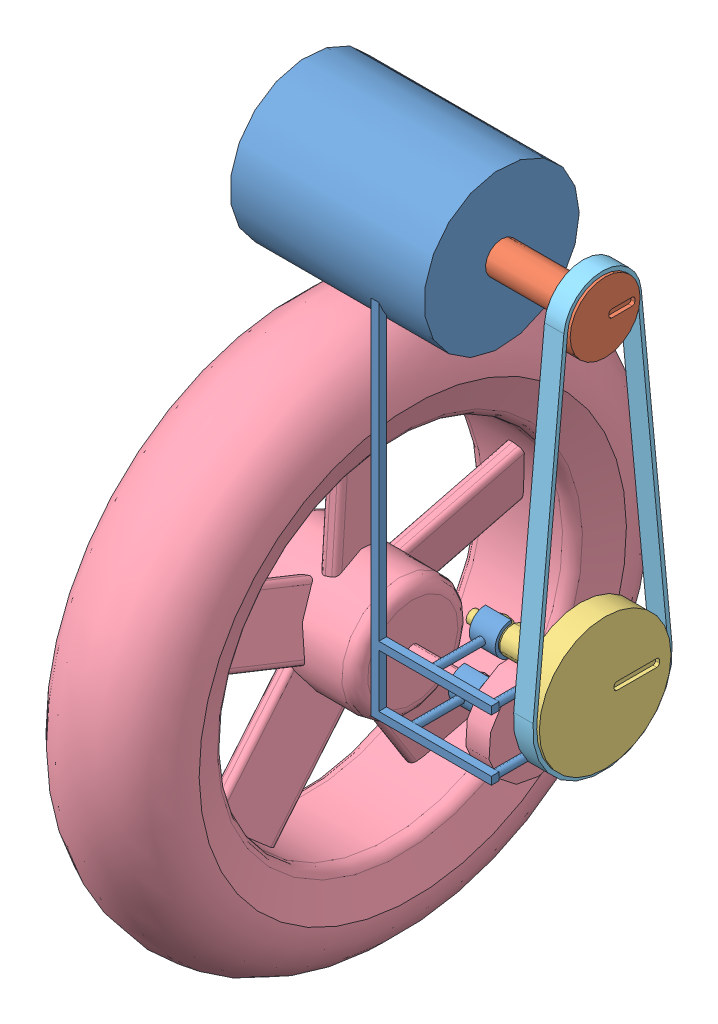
SolidWorks assembly TP Transmission SCOOT'ELEC.SLDASM, configuration Défaut (file format 4700). Lengths in mm.
Overall size (248.7 585.33 453.92).
5 component instances, 5 part files, 11 mates.
Components (placement in the parent):
- CarterSimplifié-1: CarterSimplifié.SLDPRT [Défaut] at (-15.666 -106.3725 0) size (208.75 373.37 120)
- Arbre Moteur-1: Arbre Moteur.SLDPRT [Défaut] at (-15.666 144.9975 0) x (-1 0 0) z (0 -1 0) size (95 54.11 54.11)
- Arbre Secondaire-1: Arbre Secondaire.SLDPRT [Défaut] at (-15.666 -106.3725 0) x (-1 0 0) z (0 0 -1) size (102.5 101.86 101.86)
- Arbre de roue-1: Arbre de roue.SLDPRT [Défaut] at (-15.666 -153.3725 0) x (-1 0 0) z (0 -0.065182 -0.997873) size (228.7 427 427)
- Courroie-1: Courroie.SLDPRT [Défaut] at (17.334 -106.3725 0) x (0 0 -1) z (1 0 0) size (107.86 335.35 15)
Mates (geometry in assembly coordinates):
- Coaxiale1: concentric anti-aligned: cylinder of CarterSimplifié-1 through (-80.666 144.9975 0) axis (1 0 0) radius 10; cylinder of Arbre Moteur-1 through (-15.666 144.9975 0) axis (-1 0 0) radius 10
- Coïncidente1: coincident anti-aligned: plane of CarterSimplifié-1 through (-60.666 144.9975 0) normal (1 0 0); plane of Arbre Moteur-1 through (-60.666 144.9975 -10) normal (-1 0 0)
- Coaxiale2: concentric: sphere of CarterSimplifié-1; sphere of Arbre Secondaire-1
- Coaxiale3: concentric: cylinder of CarterSimplifié-1 through (-15.666 -106.3725 0) axis (-1 0 0) radius 10; sphere of Arbre Secondaire-1
- Coaxiale4: concentric: sphere of CarterSimplifié-1; sphere of Arbre de roue-1
- Coaxiale7: concentric: cylinder of CarterSimplifié-1 through (-15.666 -153.3725 0) axis (-1 0 0) radius 10; sphere of Arbre de roue-1
- Coaxiale5: concentric anti-aligned: cylinder of Arbre Secondaire-1 through (-15.666 -106.3725 0) axis (-1 0 0) radius 50.93; cylinder of Courroie-1 through (2.334 -106.3725 0) axis (1 0 0) radius 50.93
- Coaxiale6: concentric anti-aligned: cylinder of Arbre Moteur-1 through (-15.666 144.9975 0) axis (-1 0 0) radius 27.055; cylinder of Courroie-1 through (2.334 144.9975 0) axis (1 0 0) radius 27.055
- Distance1: distance = 2 mm aligned: plane of Arbre Secondaire-1 through (0.334 -101.3725 0) normal (-1 0 0); plane of Courroie-1 through (2.334 144.9975 0) normal (-1 0 0)
- Parallèle1: parallel: line of Arbre Moteur-1 through (19.334 147.9975 -21) axis (0 0 1); plane of assembly
- Parallèle2: parallel: line of Arbre Secondaire-1 through (19.334 -103.3725 -40) axis (0 0 1); plane of assembly
